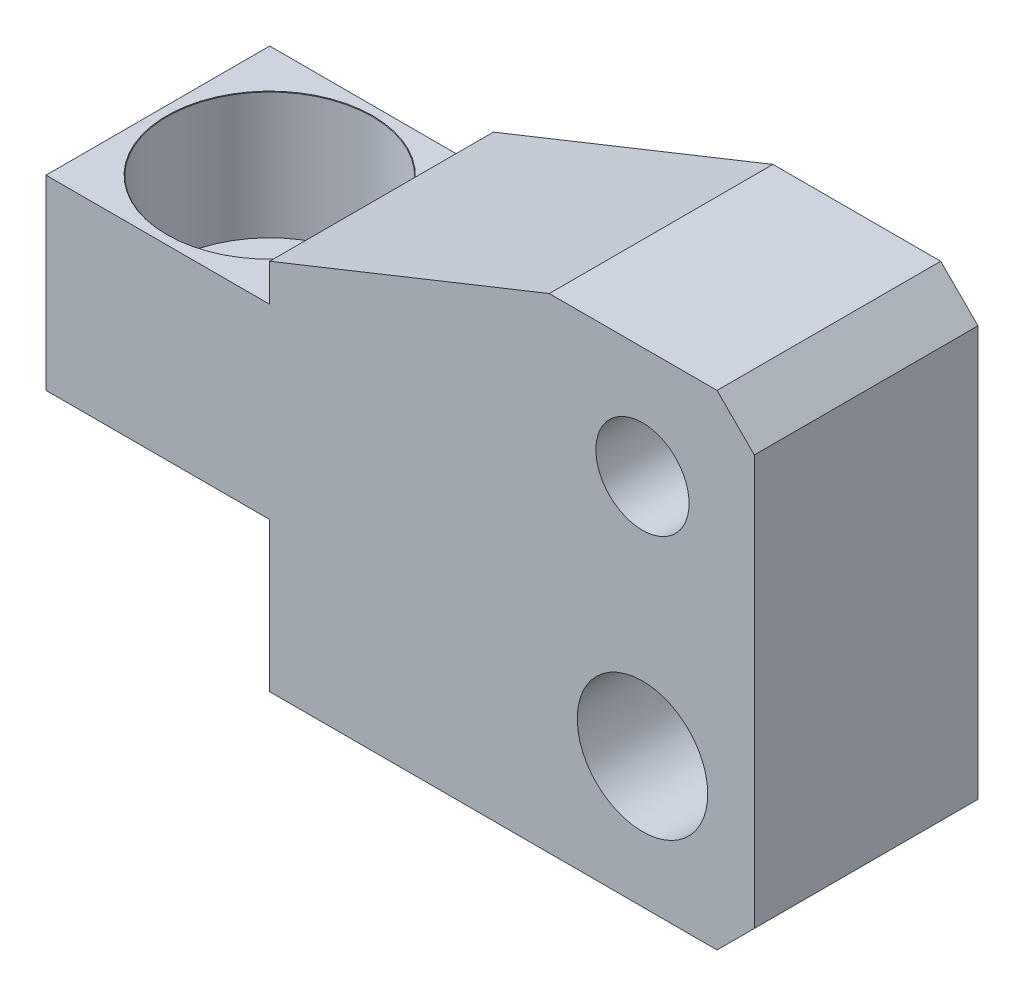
ISO-10303-21;
HEADER;
FILE_DESCRIPTION(('STEP AP214'),'2;1');
FILE_NAME('part.step','',(''),(''),'','','');
FILE_SCHEMA(('AUTOMOTIVE_DESIGN { 1 0 10303 214 1 1 1 1 }'));
ENDSEC;
DATA;
#1=APPLICATION_CONTEXT('core data for automotive mechanical design processes');
#2=APPLICATION_PROTOCOL_DEFINITION('international standard','automotive_design',2000,#1);
#3=PRODUCT_CONTEXT('',#1,'mechanical');
#4=PRODUCT('Part','Part','',(#3));
#5=PRODUCT_RELATED_PRODUCT_CATEGORY('part','',(#4));
#6=PRODUCT_DEFINITION_FORMATION('','',#4);
#7=PRODUCT_DEFINITION_CONTEXT('part definition',#1,'design');
#8=PRODUCT_DEFINITION('design','',#6,#7);
#9=PRODUCT_DEFINITION_SHAPE('','',#8);
#10=(LENGTH_UNIT() NAMED_UNIT(*) SI_UNIT(.MILLI.,.METRE.));
#11=(NAMED_UNIT(*) PLANE_ANGLE_UNIT() SI_UNIT($,.RADIAN.));
#12=(NAMED_UNIT(*) SI_UNIT($,.STERADIAN.) SOLID_ANGLE_UNIT());
#13=UNCERTAINTY_MEASURE_WITH_UNIT(LENGTH_MEASURE(1.E-05),#10,'distance_accuracy_value','');
#14=(GEOMETRIC_REPRESENTATION_CONTEXT(3) GLOBAL_UNCERTAINTY_ASSIGNED_CONTEXT((#13)) GLOBAL_UNIT_ASSIGNED_CONTEXT((#10,
#11,#12)) REPRESENTATION_CONTEXT('',''));
#15=CARTESIAN_POINT('',(0.,0.,0.));
#16=DIRECTION('',(0.,0.,1.));
#17=DIRECTION('',(1.,0.,0.));
#18=AXIS2_PLACEMENT_3D('',#15,#16,#17);
#19=CARTESIAN_POINT('',(159.801480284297,117.852870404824,12.));
#20=DIRECTION('',(1.,0.,0.));
#21=DIRECTION('',(0.,0.,-1.));
#22=AXIS2_PLACEMENT_3D('',#19,#20,#21);
#23=PLANE('',#22);
#24=DIRECTION('',(0.,-1.,0.));
#25=VECTOR('',#24,1.);
#26=CARTESIAN_POINT('',(159.801480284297,117.852870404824,0.));
#27=LINE('',#26,#25);
#28=CARTESIAN_POINT('',(159.801480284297,127.852870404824,0.));
#29=VERTEX_POINT('',#28);
#30=CARTESIAN_POINT('',(159.801480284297,117.852870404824,0.));
#31=VERTEX_POINT('',#30);
#32=EDGE_CURVE('E124',#29,#31,#27,.T.);
#33=ORIENTED_EDGE('',*,*,#32,.T.);
#34=DIRECTION('',(0.,0.,-1.));
#35=VECTOR('',#34,1.);
#36=CARTESIAN_POINT('',(159.801480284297,117.852870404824,12.));
#37=LINE('',#36,#35);
#38=CARTESIAN_POINT('',(159.801480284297,117.852870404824,12.));
#39=VERTEX_POINT('',#38);
#40=EDGE_CURVE('E106',#39,#31,#37,.T.);
#41=ORIENTED_EDGE('',*,*,#40,.F.);
#42=DIRECTION('',(0.,-1.,0.));
#43=VECTOR('',#42,1.);
#44=CARTESIAN_POINT('',(159.801480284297,117.852870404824,12.));
#45=LINE('',#44,#43);
#46=CARTESIAN_POINT('',(159.801480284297,127.852870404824,12.));
#47=VERTEX_POINT('',#46);
#48=EDGE_CURVE('E112',#47,#39,#45,.T.);
#49=ORIENTED_EDGE('',*,*,#48,.F.);
#50=DIRECTION('',(0.,0.,-1.));
#51=VECTOR('',#50,1.);
#52=CARTESIAN_POINT('',(159.801480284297,127.852870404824,12.));
#53=LINE('',#52,#51);
#54=EDGE_CURVE('E186',#47,#29,#53,.T.);
#55=ORIENTED_EDGE('',*,*,#54,.T.);
#56=EDGE_LOOP('',(#33,#41,#49,#55));
#57=FACE_BOUND('',#56,.T.);
#58=ADVANCED_FACE('F16',(#57),#23,.F.);
#59=CARTESIAN_POINT('',(159.801480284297,117.852870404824,12.));
#60=DIRECTION('',(0.,1.,0.));
#61=DIRECTION('',(0.,0.,1.));
#62=AXIS2_PLACEMENT_3D('',#59,#60,#61);
#63=PLANE('',#62);
#64=CARTESIAN_POINT('',(165.801480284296,117.852870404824,6.));
#65=DIRECTION('',(0.,1.,0.));
#66=DIRECTION('',(0.,0.,1.));
#67=AXIS2_PLACEMENT_3D('',#64,#65,#66);
#68=CIRCLE('',#67,3.325);
#69=CARTESIAN_POINT('',(165.801480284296,117.852870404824,9.325));
#70=VERTEX_POINT('',#69);
#71=EDGE_CURVE('E235',#70,#70,#68,.T.);
#72=ORIENTED_EDGE('',*,*,#71,.T.);
#73=EDGE_LOOP('',(#72));
#74=FACE_BOUND('',#73,.T.);
#75=DIRECTION('',(1.,0.,0.));
#76=VECTOR('',#75,1.);
#77=CARTESIAN_POINT('',(159.801480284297,117.852870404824,0.));
#78=LINE('',#77,#76);
#79=CARTESIAN_POINT('',(171.801480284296,117.852870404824,0.));
#80=VERTEX_POINT('',#79);
#81=EDGE_CURVE('E178',#31,#80,#78,.T.);
#82=ORIENTED_EDGE('',*,*,#81,.T.);
#83=DIRECTION('',(0.,0.,-1.));
#84=VECTOR('',#83,1.);
#85=CARTESIAN_POINT('',(171.801480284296,117.852870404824,12.));
#86=LINE('',#85,#84);
#87=CARTESIAN_POINT('',(171.801480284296,117.852870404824,12.));
#88=VERTEX_POINT('',#87);
#89=EDGE_CURVE('E109',#88,#80,#86,.T.);
#90=ORIENTED_EDGE('',*,*,#89,.F.);
#91=DIRECTION('',(1.,0.,0.));
#92=VECTOR('',#91,1.);
#93=CARTESIAN_POINT('',(159.801480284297,117.852870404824,12.));
#94=LINE('',#93,#92);
#95=EDGE_CURVE('E102',#39,#88,#94,.T.);
#96=ORIENTED_EDGE('',*,*,#95,.F.);
#97=ORIENTED_EDGE('',*,*,#40,.T.);
#98=EDGE_LOOP('',(#82,#90,#96,#97));
#99=FACE_BOUND('',#98,.T.);
#100=ADVANCED_FACE('F104',(#74,#99),#63,.F.);
#101=CARTESIAN_POINT('',(171.801480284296,117.852870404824,12.));
#102=DIRECTION('',(1.,0.,0.));
#103=DIRECTION('',(0.,0.,-1.));
#104=AXIS2_PLACEMENT_3D('',#101,#102,#103);
#105=PLANE('',#104);
#106=DIRECTION('',(0.,-1.,0.));
#107=VECTOR('',#106,1.);
#108=CARTESIAN_POINT('',(171.801480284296,117.852870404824,0.));
#109=LINE('',#108,#107);
#110=CARTESIAN_POINT('',(171.801480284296,109.852870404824,0.));
#111=VERTEX_POINT('',#110);
#112=EDGE_CURVE('E174',#80,#111,#109,.T.);
#113=ORIENTED_EDGE('',*,*,#112,.T.);
#114=DIRECTION('',(0.,0.,-1.));
#115=VECTOR('',#114,1.);
#116=CARTESIAN_POINT('',(171.801480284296,109.852870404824,12.));
#117=LINE('',#116,#115);
#118=CARTESIAN_POINT('',(171.801480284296,109.852870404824,12.));
#119=VERTEX_POINT('',#118);
#120=EDGE_CURVE('E130',#119,#111,#117,.T.);
#121=ORIENTED_EDGE('',*,*,#120,.F.);
#122=DIRECTION('',(0.,-1.,0.));
#123=VECTOR('',#122,1.);
#124=CARTESIAN_POINT('',(171.801480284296,117.852870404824,12.));
#125=LINE('',#124,#123);
#126=EDGE_CURVE('E111',#88,#119,#125,.T.);
#127=ORIENTED_EDGE('',*,*,#126,.F.);
#128=ORIENTED_EDGE('',*,*,#89,.T.);
#129=EDGE_LOOP('',(#113,#121,#127,#128));
#130=FACE_BOUND('',#129,.T.);
#131=ADVANCED_FACE('F297',(#130),#105,.F.);
#132=CARTESIAN_POINT('',(197.801480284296,109.852870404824,12.));
#133=DIRECTION('',(0.,1.,0.));
#134=DIRECTION('',(0.,0.,1.));
#135=AXIS2_PLACEMENT_3D('',#132,#133,#134);
#136=PLANE('',#135);
#137=DIRECTION('',(1.,0.,0.));
#138=VECTOR('',#137,1.);
#139=CARTESIAN_POINT('',(197.801480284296,109.852870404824,0.));
#140=LINE('',#139,#138);
#141=CARTESIAN_POINT('',(195.801480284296,109.852870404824,0.));
#142=VERTEX_POINT('',#141);
#143=EDGE_CURVE('E169',#111,#142,#140,.T.);
#144=ORIENTED_EDGE('',*,*,#143,.T.);
#145=DIRECTION('',(0.,0.,1.));
#146=VECTOR('',#145,1.);
#147=CARTESIAN_POINT('',(195.801480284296,109.852870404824,12.));
#148=LINE('',#147,#146);
#149=CARTESIAN_POINT('',(195.801480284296,109.852870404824,12.));
#150=VERTEX_POINT('',#149);
#151=EDGE_CURVE('E39',#142,#150,#148,.T.);
#152=ORIENTED_EDGE('',*,*,#151,.T.);
#153=DIRECTION('',(1.,0.,0.));
#154=VECTOR('',#153,1.);
#155=CARTESIAN_POINT('',(197.801480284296,109.852870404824,12.));
#156=LINE('',#155,#154);
#157=EDGE_CURVE('E154',#119,#150,#156,.T.);
#158=ORIENTED_EDGE('',*,*,#157,.F.);
#159=ORIENTED_EDGE('',*,*,#120,.T.);
#160=EDGE_LOOP('',(#144,#152,#158,#159));
#161=FACE_BOUND('',#160,.T.);
#162=ADVANCED_FACE('F172',(#161),#136,.F.);
#163=CARTESIAN_POINT('',(197.801480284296,109.852870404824,12.));
#164=DIRECTION('',(-1.,0.,0.));
#165=DIRECTION('',(0.,0.,1.));
#166=AXIS2_PLACEMENT_3D('',#163,#164,#165);
#167=PLANE('',#166);
#168=DIRECTION('',(0.,1.,0.));
#169=VECTOR('',#168,1.);
#170=CARTESIAN_POINT('',(197.801480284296,109.852870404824,12.));
#171=LINE('',#170,#169);
#172=CARTESIAN_POINT('',(197.801480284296,111.852870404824,12.));
#173=VERTEX_POINT('',#172);
#174=CARTESIAN_POINT('',(197.801480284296,133.852870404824,12.));
#175=VERTEX_POINT('',#174);
#176=EDGE_CURVE('E153',#173,#175,#171,.T.);
#177=ORIENTED_EDGE('',*,*,#176,.F.);
#178=DIRECTION('',(0.,0.,-1.));
#179=VECTOR('',#178,1.);
#180=CARTESIAN_POINT('',(197.801480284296,111.852870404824,12.));
#181=LINE('',#180,#179);
#182=CARTESIAN_POINT('',(197.801480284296,111.852870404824,0.));
#183=VERTEX_POINT('',#182);
#184=EDGE_CURVE('E143',#173,#183,#181,.T.);
#185=ORIENTED_EDGE('',*,*,#184,.T.);
#186=DIRECTION('',(0.,1.,0.));
#187=VECTOR('',#186,1.);
#188=CARTESIAN_POINT('',(197.801480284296,109.852870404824,0.));
#189=LINE('',#188,#187);
#190=CARTESIAN_POINT('',(197.801480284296,133.852870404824,0.));
#191=VERTEX_POINT('',#190);
#192=EDGE_CURVE('E170',#183,#191,#189,.T.);
#193=ORIENTED_EDGE('',*,*,#192,.T.);
#194=DIRECTION('',(0.,0.,1.));
#195=VECTOR('',#194,1.);
#196=CARTESIAN_POINT('',(197.801480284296,133.852870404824,12.));
#197=LINE('',#196,#195);
#198=EDGE_CURVE('E141',#191,#175,#197,.T.);
#199=ORIENTED_EDGE('',*,*,#198,.T.);
#200=EDGE_LOOP('',(#177,#185,#193,#199));
#201=FACE_BOUND('',#200,.T.);
#202=ADVANCED_FACE('F158',(#201),#167,.F.);
#203=CARTESIAN_POINT('',(171.801480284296,135.852870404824,12.));
#204=DIRECTION('',(0.,-1.,0.));
#205=DIRECTION('',(0.,0.,-1.));
#206=AXIS2_PLACEMENT_3D('',#203,#204,#205);
#207=PLANE('',#206);
#208=DIRECTION('',(-1.,0.,0.));
#209=VECTOR('',#208,1.);
#210=CARTESIAN_POINT('',(171.801480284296,135.852870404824,12.));
#211=LINE('',#210,#209);
#212=CARTESIAN_POINT('',(195.801480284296,135.852870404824,12.));
#213=VERTEX_POINT('',#212);
#214=CARTESIAN_POINT('',(186.801480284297,135.852870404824,12.));
#215=VERTEX_POINT('',#214);
#216=EDGE_CURVE('E162',#213,#215,#211,.T.);
#217=ORIENTED_EDGE('',*,*,#216,.F.);
#218=DIRECTION('',(0.,0.,-1.));
#219=VECTOR('',#218,1.);
#220=CARTESIAN_POINT('',(195.801480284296,135.852870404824,12.));
#221=LINE('',#220,#219);
#222=CARTESIAN_POINT('',(195.801480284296,135.852870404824,0.));
#223=VERTEX_POINT('',#222);
#224=EDGE_CURVE('E11',#213,#223,#221,.T.);
#225=ORIENTED_EDGE('',*,*,#224,.T.);
#226=DIRECTION('',(-1.,0.,0.));
#227=VECTOR('',#226,1.);
#228=CARTESIAN_POINT('',(171.801480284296,135.852870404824,0.));
#229=LINE('',#228,#227);
#230=CARTESIAN_POINT('',(186.801480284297,135.852870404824,0.));
#231=VERTEX_POINT('',#230);
#232=EDGE_CURVE('E176',#223,#231,#229,.T.);
#233=ORIENTED_EDGE('',*,*,#232,.T.);
#234=DIRECTION('',(0.,0.,1.));
#235=VECTOR('',#234,1.);
#236=CARTESIAN_POINT('',(186.801480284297,135.852870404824,12.));
#237=LINE('',#236,#235);
#238=EDGE_CURVE('E136',#231,#215,#237,.T.);
#239=ORIENTED_EDGE('',*,*,#238,.T.);
#240=EDGE_LOOP('',(#217,#225,#233,#239));
#241=FACE_BOUND('',#240,.T.);
#242=ADVANCED_FACE('F288',(#241),#207,.F.);
#243=CARTESIAN_POINT('',(171.801480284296,127.852870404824,12.));
#244=DIRECTION('',(1.,0.,0.));
#245=DIRECTION('',(0.,0.,-1.));
#246=AXIS2_PLACEMENT_3D('',#243,#244,#245);
#247=PLANE('',#246);
#248=DIRECTION('',(0.,-1.,0.));
#249=VECTOR('',#248,1.);
#250=CARTESIAN_POINT('',(171.801480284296,127.852870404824,12.));
#251=LINE('',#250,#249);
#252=CARTESIAN_POINT('',(171.801480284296,129.852870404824,12.));
#253=VERTEX_POINT('',#252);
#254=CARTESIAN_POINT('',(171.801480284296,127.852870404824,12.));
#255=VERTEX_POINT('',#254);
#256=EDGE_CURVE('E204',#253,#255,#251,.T.);
#257=ORIENTED_EDGE('',*,*,#256,.F.);
#258=DIRECTION('',(0.,0.,-1.));
#259=VECTOR('',#258,1.);
#260=CARTESIAN_POINT('',(171.801480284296,129.852870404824,12.));
#261=LINE('',#260,#259);
#262=CARTESIAN_POINT('',(171.801480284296,129.852870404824,0.));
#263=VERTEX_POINT('',#262);
#264=EDGE_CURVE('E125',#253,#263,#261,.T.);
#265=ORIENTED_EDGE('',*,*,#264,.T.);
#266=DIRECTION('',(0.,-1.,0.));
#267=VECTOR('',#266,1.);
#268=CARTESIAN_POINT('',(171.801480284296,127.852870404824,0.));
#269=LINE('',#268,#267);
#270=CARTESIAN_POINT('',(171.801480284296,127.852870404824,0.));
#271=VERTEX_POINT('',#270);
#272=EDGE_CURVE('E183',#263,#271,#269,.T.);
#273=ORIENTED_EDGE('',*,*,#272,.T.);
#274=DIRECTION('',(0.,0.,-1.));
#275=VECTOR('',#274,1.);
#276=CARTESIAN_POINT('',(171.801480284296,127.852870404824,12.));
#277=LINE('',#276,#275);
#278=EDGE_CURVE('E188',#255,#271,#277,.T.);
#279=ORIENTED_EDGE('',*,*,#278,.F.);
#280=EDGE_LOOP('',(#257,#265,#273,#279));
#281=FACE_BOUND('',#280,.T.);
#282=ADVANCED_FACE('F278',(#281),#247,.F.);
#283=CARTESIAN_POINT('',(159.801480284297,127.852870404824,12.));
#284=DIRECTION('',(0.,-1.,0.));
#285=DIRECTION('',(0.,0.,-1.));
#286=AXIS2_PLACEMENT_3D('',#283,#284,#285);
#287=PLANE('',#286);
#288=CARTESIAN_POINT('',(165.801480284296,127.852870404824,6.));
#289=DIRECTION('',(0.,1.,0.));
#290=DIRECTION('',(0.,0.,1.));
#291=AXIS2_PLACEMENT_3D('',#288,#289,#290);
#292=CIRCLE('',#291,5.525);
#293=CARTESIAN_POINT('',(165.801480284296,127.852870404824,11.525));
#294=VERTEX_POINT('',#293);
#295=EDGE_CURVE('E232',#294,#294,#292,.T.);
#296=ORIENTED_EDGE('',*,*,#295,.F.);
#297=EDGE_LOOP('',(#296));
#298=FACE_BOUND('',#297,.T.);
#299=DIRECTION('',(-1.,0.,0.));
#300=VECTOR('',#299,1.);
#301=CARTESIAN_POINT('',(159.801480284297,127.852870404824,0.));
#302=LINE('',#301,#300);
#303=EDGE_CURVE('E121',#271,#29,#302,.T.);
#304=ORIENTED_EDGE('',*,*,#303,.T.);
#305=ORIENTED_EDGE('',*,*,#54,.F.);
#306=DIRECTION('',(-1.,0.,0.));
#307=VECTOR('',#306,1.);
#308=CARTESIAN_POINT('',(159.801480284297,127.852870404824,12.));
#309=LINE('',#308,#307);
#310=EDGE_CURVE('E117',#255,#47,#309,.T.);
#311=ORIENTED_EDGE('',*,*,#310,.F.);
#312=ORIENTED_EDGE('',*,*,#278,.T.);
#313=EDGE_LOOP('',(#304,#305,#311,#312));
#314=FACE_BOUND('',#313,.T.);
#315=ADVANCED_FACE('F193',(#298,#314),#287,.F.);
#316=CARTESIAN_POINT('',(0.,0.,12.));
#317=DIRECTION('',(0.,0.,-1.));
#318=DIRECTION('',(-1.,0.,0.));
#319=AXIS2_PLACEMENT_3D('',#316,#317,#318);
#320=PLANE('',#319);
#321=CARTESIAN_POINT('',(191.801480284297,116.852870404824,12.));
#322=DIRECTION('',(0.,0.,1.));
#323=DIRECTION('',(1.,0.,0.));
#324=AXIS2_PLACEMENT_3D('',#321,#322,#323);
#325=CIRCLE('',#324,3.5);
#326=CARTESIAN_POINT('',(195.301480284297,116.852870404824,12.));
#327=VERTEX_POINT('',#326);
#328=EDGE_CURVE('E214',#327,#327,#325,.T.);
#329=ORIENTED_EDGE('',*,*,#328,.F.);
#330=EDGE_LOOP('',(#329));
#331=FACE_BOUND('',#330,.T.);
#332=CARTESIAN_POINT('',(191.801480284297,129.852870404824,12.));
#333=DIRECTION('',(0.,0.,1.));
#334=DIRECTION('',(1.,0.,0.));
#335=AXIS2_PLACEMENT_3D('',#332,#333,#334);
#336=CIRCLE('',#335,2.5);
#337=CARTESIAN_POINT('',(194.301480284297,129.852870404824,12.));
#338=VERTEX_POINT('',#337);
#339=EDGE_CURVE('E200',#338,#338,#336,.T.);
#340=ORIENTED_EDGE('',*,*,#339,.F.);
#341=EDGE_LOOP('',(#340));
#342=FACE_BOUND('',#341,.T.);
#343=ORIENTED_EDGE('',*,*,#157,.T.);
#344=DIRECTION('',(-0.70710678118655,-0.707106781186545,0.));
#345=VECTOR('',#344,1.);
#346=CARTESIAN_POINT('',(197.801480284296,111.852870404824,12.));
#347=LINE('',#346,#345);
#348=EDGE_CURVE('E24',#150,#173,#347,.F.);
#349=ORIENTED_EDGE('',*,*,#348,.T.);
#350=ORIENTED_EDGE('',*,*,#176,.T.);
#351=DIRECTION('',(0.707106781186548,-0.707106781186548,0.));
#352=VECTOR('',#351,1.);
#353=CARTESIAN_POINT('',(195.801480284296,135.852870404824,12.));
#354=LINE('',#353,#352);
#355=EDGE_CURVE('E31',#175,#213,#354,.F.);
#356=ORIENTED_EDGE('',*,*,#355,.T.);
#357=ORIENTED_EDGE('',*,*,#216,.T.);
#358=DIRECTION('',(0.92847669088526,0.371390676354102,0.));
#359=VECTOR('',#358,1.);
#360=CARTESIAN_POINT('',(171.801480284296,129.852870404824,12.));
#361=LINE('',#360,#359);
#362=EDGE_CURVE('E139',#215,#253,#361,.F.);
#363=ORIENTED_EDGE('',*,*,#362,.T.);
#364=ORIENTED_EDGE('',*,*,#256,.T.);
#365=ORIENTED_EDGE('',*,*,#310,.T.);
#366=ORIENTED_EDGE('',*,*,#48,.T.);
#367=ORIENTED_EDGE('',*,*,#95,.T.);
#368=ORIENTED_EDGE('',*,*,#126,.T.);
#369=EDGE_LOOP('',(#343,#349,#350,#356,#357,#363,#364,#365,#366,#367,#368));
#370=FACE_BOUND('',#369,.T.);
#371=ADVANCED_FACE('F115',(#331,#342,#370),#320,.F.);
#372=CARTESIAN_POINT('',(0.,0.,0.));
#373=DIRECTION('',(0.,0.,-1.));
#374=DIRECTION('',(-1.,0.,0.));
#375=AXIS2_PLACEMENT_3D('',#372,#373,#374);
#376=PLANE('',#375);
#377=CARTESIAN_POINT('',(191.801480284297,116.852870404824,0.));
#378=DIRECTION('',(0.,0.,1.));
#379=DIRECTION('',(1.,0.,0.));
#380=AXIS2_PLACEMENT_3D('',#377,#378,#379);
#381=CIRCLE('',#380,3.5);
#382=CARTESIAN_POINT('',(195.301480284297,116.852870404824,0.));
#383=VERTEX_POINT('',#382);
#384=EDGE_CURVE('E211',#383,#383,#381,.T.);
#385=ORIENTED_EDGE('',*,*,#384,.T.);
#386=EDGE_LOOP('',(#385));
#387=FACE_BOUND('',#386,.T.);
#388=CARTESIAN_POINT('',(191.801480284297,129.852870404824,0.));
#389=DIRECTION('',(0.,0.,1.));
#390=DIRECTION('',(1.,0.,0.));
#391=AXIS2_PLACEMENT_3D('',#388,#389,#390);
#392=CIRCLE('',#391,2.5);
#393=CARTESIAN_POINT('',(194.301480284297,129.852870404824,0.));
#394=VERTEX_POINT('',#393);
#395=EDGE_CURVE('E197',#394,#394,#392,.T.);
#396=ORIENTED_EDGE('',*,*,#395,.T.);
#397=EDGE_LOOP('',(#396));
#398=FACE_BOUND('',#397,.T.);
#399=ORIENTED_EDGE('',*,*,#192,.F.);
#400=DIRECTION('',(0.70710678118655,0.707106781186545,0.));
#401=VECTOR('',#400,1.);
#402=CARTESIAN_POINT('',(42.9743049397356,-42.9743049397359,0.));
#403=LINE('',#402,#401);
#404=EDGE_CURVE('E148',#183,#142,#403,.F.);
#405=ORIENTED_EDGE('',*,*,#404,.T.);
#406=ORIENTED_EDGE('',*,*,#143,.F.);
#407=ORIENTED_EDGE('',*,*,#112,.F.);
#408=ORIENTED_EDGE('',*,*,#81,.F.);
#409=ORIENTED_EDGE('',*,*,#32,.F.);
#410=ORIENTED_EDGE('',*,*,#303,.F.);
#411=ORIENTED_EDGE('',*,*,#272,.F.);
#412=DIRECTION('',(-0.92847669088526,-0.371390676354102,0.));
#413=VECTOR('',#412,1.);
#414=CARTESIAN_POINT('',(-21.0800959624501,52.7002399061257,0.));
#415=LINE('',#414,#413);
#416=EDGE_CURVE('E128',#263,#231,#415,.F.);
#417=ORIENTED_EDGE('',*,*,#416,.T.);
#418=ORIENTED_EDGE('',*,*,#232,.F.);
#419=DIRECTION('',(-0.707106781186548,0.707106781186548,0.));
#420=VECTOR('',#419,1.);
#421=CARTESIAN_POINT('',(165.82717534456,165.82717534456,0.));
#422=LINE('',#421,#420);
#423=EDGE_CURVE('E146',#223,#191,#422,.F.);
#424=ORIENTED_EDGE('',*,*,#423,.T.);
#425=EDGE_LOOP('',(#399,#405,#406,#407,#408,#409,#410,#411,#417,#418,#424));
#426=FACE_BOUND('',#425,.T.);
#427=ADVANCED_FACE('F167',(#387,#398,#426),#376,.T.);
#428=CARTESIAN_POINT('',(171.801480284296,129.852870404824,12.));
#429=DIRECTION('',(0.371390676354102,-0.92847669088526,0.));
#430=DIRECTION('',(0.,0.,-1.));
#431=AXIS2_PLACEMENT_3D('',#428,#429,#430);
#432=PLANE('',#431);
#433=ORIENTED_EDGE('',*,*,#362,.F.);
#434=ORIENTED_EDGE('',*,*,#238,.F.);
#435=ORIENTED_EDGE('',*,*,#416,.F.);
#436=ORIENTED_EDGE('',*,*,#264,.F.);
#437=EDGE_LOOP('',(#433,#434,#435,#436));
#438=FACE_BOUND('',#437,.T.);
#439=ADVANCED_FACE('F301',(#438),#432,.F.);
#440=CARTESIAN_POINT('',(191.801480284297,129.852870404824,12.));
#441=DIRECTION('',(0.,0.,1.));
#442=DIRECTION('',(1.,0.,0.));
#443=AXIS2_PLACEMENT_3D('',#440,#441,#442);
#444=CYLINDRICAL_SURFACE('',#443,2.5);
#445=ORIENTED_EDGE('',*,*,#395,.F.);
#446=EDGE_LOOP('',(#445));
#447=FACE_BOUND('',#446,.T.);
#448=ORIENTED_EDGE('',*,*,#339,.T.);
#449=EDGE_LOOP('',(#448));
#450=FACE_BOUND('',#449,.T.);
#451=ADVANCED_FACE('F303',(#447,#450),#444,.F.);
#452=CARTESIAN_POINT('',(191.801480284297,116.852870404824,12.));
#453=DIRECTION('',(0.,0.,1.));
#454=DIRECTION('',(1.,0.,0.));
#455=AXIS2_PLACEMENT_3D('',#452,#453,#454);
#456=CYLINDRICAL_SURFACE('',#455,3.5);
#457=ORIENTED_EDGE('',*,*,#384,.F.);
#458=EDGE_LOOP('',(#457));
#459=FACE_BOUND('',#458,.T.);
#460=ORIENTED_EDGE('',*,*,#328,.T.);
#461=EDGE_LOOP('',(#460));
#462=FACE_BOUND('',#461,.T.);
#463=ADVANCED_FACE('F244',(#459,#462),#456,.F.);
#464=CARTESIAN_POINT('',(165.801480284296,117.877870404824,6.));
#465=DIRECTION('',(0.,-1.,0.));
#466=DIRECTION('',(0.,0.,-1.));
#467=AXIS2_PLACEMENT_3D('',#464,#465,#466);
#468=CONICAL_SURFACE('',#467,3.3,0.785398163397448);
#469=ORIENTED_EDGE('',*,*,#71,.F.);
#470=EDGE_LOOP('',(#469));
#471=FACE_BOUND('',#470,.T.);
#472=CARTESIAN_POINT('',(165.801480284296,117.877870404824,6.));
#473=DIRECTION('',(0.,1.,0.));
#474=DIRECTION('',(0.,0.,1.));
#475=AXIS2_PLACEMENT_3D('',#472,#473,#474);
#476=CIRCLE('',#475,3.3);
#477=CARTESIAN_POINT('',(165.801480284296,117.877870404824,9.3));
#478=VERTEX_POINT('',#477);
#479=EDGE_CURVE('E217',#478,#478,#476,.T.);
#480=ORIENTED_EDGE('',*,*,#479,.T.);
#481=EDGE_LOOP('',(#480));
#482=FACE_BOUND('',#481,.T.);
#483=ADVANCED_FACE('F240',(#471,#482),#468,.F.);
#484=CARTESIAN_POINT('',(165.801480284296,127.852870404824,6.));
#485=DIRECTION('',(0.,1.,0.));
#486=DIRECTION('',(0.,0.,1.));
#487=AXIS2_PLACEMENT_3D('',#484,#485,#486);
#488=CYLINDRICAL_SURFACE('',#487,3.3);
#489=ORIENTED_EDGE('',*,*,#479,.F.);
#490=EDGE_LOOP('',(#489));
#491=FACE_BOUND('',#490,.T.);
#492=CARTESIAN_POINT('',(165.801480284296,121.027870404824,6.));
#493=DIRECTION('',(0.,1.,0.));
#494=DIRECTION('',(0.,0.,1.));
#495=AXIS2_PLACEMENT_3D('',#492,#493,#494);
#496=CIRCLE('',#495,3.3);
#497=CARTESIAN_POINT('',(165.801480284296,121.027870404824,9.3));
#498=VERTEX_POINT('',#497);
#499=EDGE_CURVE('E220',#498,#498,#496,.T.);
#500=ORIENTED_EDGE('',*,*,#499,.T.);
#501=EDGE_LOOP('',(#500));
#502=FACE_BOUND('',#501,.T.);
#503=ADVANCED_FACE('F243',(#491,#502),#488,.F.);
#504=CARTESIAN_POINT('',(165.801480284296,121.052870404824,6.));
#505=DIRECTION('',(0.,1.,0.));
#506=DIRECTION('',(0.,0.,1.));
#507=AXIS2_PLACEMENT_3D('',#504,#505,#506);
#508=CONICAL_SURFACE('',#507,3.325,0.785398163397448);
#509=ORIENTED_EDGE('',*,*,#499,.F.);
#510=EDGE_LOOP('',(#509));
#511=FACE_BOUND('',#510,.T.);
#512=CARTESIAN_POINT('',(165.801480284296,121.052870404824,6.));
#513=DIRECTION('',(0.,1.,0.));
#514=DIRECTION('',(0.,0.,1.));
#515=AXIS2_PLACEMENT_3D('',#512,#513,#514);
#516=CIRCLE('',#515,3.325);
#517=CARTESIAN_POINT('',(165.801480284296,121.052870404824,9.325));
#518=VERTEX_POINT('',#517);
#519=EDGE_CURVE('E223',#518,#518,#516,.T.);
#520=ORIENTED_EDGE('',*,*,#519,.T.);
#521=EDGE_LOOP('',(#520));
#522=FACE_BOUND('',#521,.T.);
#523=ADVANCED_FACE('F250',(#511,#522),#508,.F.);
#524=CARTESIAN_POINT('',(169.126480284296,121.052870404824,6.));
#525=DIRECTION('',(0.,-1.,0.));
#526=DIRECTION('',(0.,0.,-1.));
#527=AXIS2_PLACEMENT_3D('',#524,#525,#526);
#528=PLANE('',#527);
#529=ORIENTED_EDGE('',*,*,#519,.F.);
#530=EDGE_LOOP('',(#529));
#531=FACE_BOUND('',#530,.T.);
#532=CARTESIAN_POINT('',(165.801480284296,121.052870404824,6.));
#533=DIRECTION('',(0.,1.,0.));
#534=DIRECTION('',(0.,0.,1.));
#535=AXIS2_PLACEMENT_3D('',#532,#533,#534);
#536=CIRCLE('',#535,5.5);
#537=CARTESIAN_POINT('',(165.801480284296,121.052870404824,11.5));
#538=VERTEX_POINT('',#537);
#539=EDGE_CURVE('E226',#538,#538,#536,.T.);
#540=ORIENTED_EDGE('',*,*,#539,.T.);
#541=EDGE_LOOP('',(#540));
#542=FACE_BOUND('',#541,.T.);
#543=ADVANCED_FACE('F256',(#531,#542),#528,.F.);
#544=CARTESIAN_POINT('',(165.801480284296,127.852870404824,6.));
#545=DIRECTION('',(0.,1.,0.));
#546=DIRECTION('',(0.,0.,1.));
#547=AXIS2_PLACEMENT_3D('',#544,#545,#546);
#548=CYLINDRICAL_SURFACE('',#547,5.5);
#549=ORIENTED_EDGE('',*,*,#539,.F.);
#550=EDGE_LOOP('',(#549));
#551=FACE_BOUND('',#550,.T.);
#552=CARTESIAN_POINT('',(165.801480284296,127.827870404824,6.));
#553=DIRECTION('',(0.,1.,0.));
#554=DIRECTION('',(0.,0.,1.));
#555=AXIS2_PLACEMENT_3D('',#552,#553,#554);
#556=CIRCLE('',#555,5.5);
#557=CARTESIAN_POINT('',(165.801480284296,127.827870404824,11.5));
#558=VERTEX_POINT('',#557);
#559=EDGE_CURVE('E229',#558,#558,#556,.T.);
#560=ORIENTED_EDGE('',*,*,#559,.T.);
#561=EDGE_LOOP('',(#560));
#562=FACE_BOUND('',#561,.T.);
#563=ADVANCED_FACE('F262',(#551,#562),#548,.F.);
#564=CARTESIAN_POINT('',(165.801480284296,127.852870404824,6.));
#565=DIRECTION('',(0.,1.,0.));
#566=DIRECTION('',(0.,0.,1.));
#567=AXIS2_PLACEMENT_3D('',#564,#565,#566);
#568=CONICAL_SURFACE('',#567,5.525,0.785398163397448);
#569=ORIENTED_EDGE('',*,*,#559,.F.);
#570=EDGE_LOOP('',(#569));
#571=FACE_BOUND('',#570,.T.);
#572=ORIENTED_EDGE('',*,*,#295,.T.);
#573=EDGE_LOOP('',(#572));
#574=FACE_BOUND('',#573,.T.);
#575=ADVANCED_FACE('F268',(#571,#574),#568,.F.);
#576=CARTESIAN_POINT('',(197.801480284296,111.852870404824,12.));
#577=DIRECTION('',(-0.707106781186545,0.70710678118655,0.));
#578=DIRECTION('',(0.,0.,-1.));
#579=AXIS2_PLACEMENT_3D('',#576,#577,#578);
#580=PLANE('',#579);
#581=ORIENTED_EDGE('',*,*,#348,.F.);
#582=ORIENTED_EDGE('',*,*,#151,.F.);
#583=ORIENTED_EDGE('',*,*,#404,.F.);
#584=ORIENTED_EDGE('',*,*,#184,.F.);
#585=EDGE_LOOP('',(#581,#582,#583,#584));
#586=FACE_BOUND('',#585,.T.);
#587=ADVANCED_FACE('F164',(#586),#580,.F.);
#588=CARTESIAN_POINT('',(195.801480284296,135.852870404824,12.));
#589=DIRECTION('',(-0.707106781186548,-0.707106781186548,0.));
#590=DIRECTION('',(0.,0.,-1.));
#591=AXIS2_PLACEMENT_3D('',#588,#589,#590);
#592=PLANE('',#591);
#593=ORIENTED_EDGE('',*,*,#355,.F.);
#594=ORIENTED_EDGE('',*,*,#198,.F.);
#595=ORIENTED_EDGE('',*,*,#423,.F.);
#596=ORIENTED_EDGE('',*,*,#224,.F.);
#597=EDGE_LOOP('',(#593,#594,#595,#596));
#598=FACE_BOUND('',#597,.T.);
#599=ADVANCED_FACE('F18',(#598),#592,.F.);
#600=CLOSED_SHELL('',(#58,#100,#131,#162,#202,#242,#282,#315,#371,#427,#439,#451,#463,#483,#503,
#523,#543,#563,#575,#587,#599));
#601=MANIFOLD_SOLID_BREP('B1',#600);
#602=ADVANCED_BREP_SHAPE_REPRESENTATION('',(#18,#601),#14);
#603=SHAPE_DEFINITION_REPRESENTATION(#9,#602);
ENDSEC;
END-ISO-10303-21;
